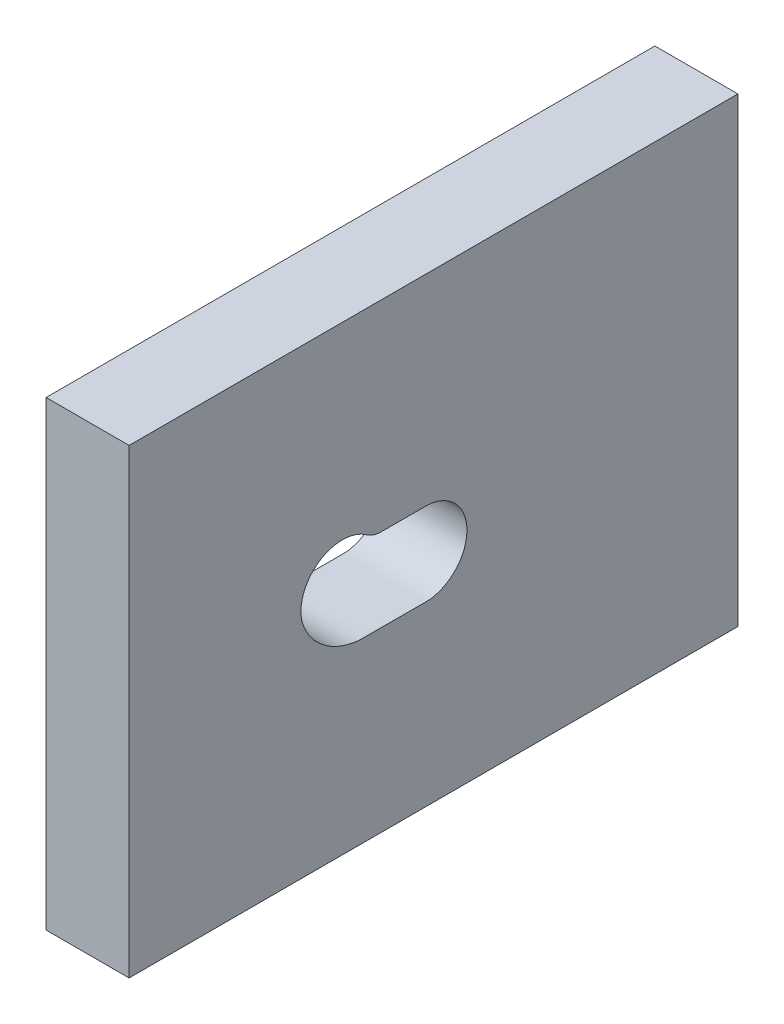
ISO-10303-21;
HEADER;
FILE_DESCRIPTION(('STEP AP214'),'2;1');
FILE_NAME('part.step','',(''),(''),'','','');
FILE_SCHEMA(('AUTOMOTIVE_DESIGN { 1 0 10303 214 1 1 1 1 }'));
ENDSEC;
DATA;
#1=APPLICATION_CONTEXT('core data for automotive mechanical design processes');
#2=APPLICATION_PROTOCOL_DEFINITION('international standard','automotive_design',2000,#1);
#3=PRODUCT_CONTEXT('',#1,'mechanical');
#4=PRODUCT('Part','Part','',(#3));
#5=PRODUCT_RELATED_PRODUCT_CATEGORY('part','',(#4));
#6=PRODUCT_DEFINITION_FORMATION('','',#4);
#7=PRODUCT_DEFINITION_CONTEXT('part definition',#1,'design');
#8=PRODUCT_DEFINITION('design','',#6,#7);
#9=PRODUCT_DEFINITION_SHAPE('','',#8);
#10=(LENGTH_UNIT() NAMED_UNIT(*) SI_UNIT(.MILLI.,.METRE.));
#11=(NAMED_UNIT(*) PLANE_ANGLE_UNIT() SI_UNIT($,.RADIAN.));
#12=(NAMED_UNIT(*) SI_UNIT($,.STERADIAN.) SOLID_ANGLE_UNIT());
#13=UNCERTAINTY_MEASURE_WITH_UNIT(LENGTH_MEASURE(1.E-05),#10,'distance_accuracy_value','');
#14=(GEOMETRIC_REPRESENTATION_CONTEXT(3) GLOBAL_UNCERTAINTY_ASSIGNED_CONTEXT((#13)) GLOBAL_UNIT_ASSIGNED_CONTEXT((#10,
#11,#12)) REPRESENTATION_CONTEXT('',''));
#15=CARTESIAN_POINT('',(0.,0.,0.));
#16=DIRECTION('',(0.,0.,1.));
#17=DIRECTION('',(1.,0.,0.));
#18=AXIS2_PLACEMENT_3D('',#15,#16,#17);
#19=CARTESIAN_POINT('',(20.,-52.7269870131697,60.7218289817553));
#20=DIRECTION('',(1.,0.,0.));
#21=DIRECTION('',(0.,0.,-1.));
#22=AXIS2_PLACEMENT_3D('',#19,#20,#21);
#23=PLANE('',#22);
#24=DIRECTION('',(0.,-1.,0.));
#25=VECTOR('',#24,1.);
#26=CARTESIAN_POINT('',(20.,58.40035883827,60.7218289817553));
#27=LINE('',#26,#25);
#28=CARTESIAN_POINT('',(20.,58.40035883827,60.7218289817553));
#29=VERTEX_POINT('',#28);
#30=CARTESIAN_POINT('',(20.,-52.7269870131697,60.7218289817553));
#31=VERTEX_POINT('',#30);
#32=EDGE_CURVE('E85',#29,#31,#27,.T.);
#33=ORIENTED_EDGE('',*,*,#32,.T.);
#34=DIRECTION('',(0.,0.,-1.));
#35=VECTOR('',#34,1.);
#36=CARTESIAN_POINT('',(20.,-52.7269870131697,60.7218289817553));
#37=LINE('',#36,#35);
#38=CARTESIAN_POINT('',(20.,-52.7269870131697,-85.9508171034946));
#39=VERTEX_POINT('',#38);
#40=EDGE_CURVE('E80',#31,#39,#37,.T.);
#41=ORIENTED_EDGE('',*,*,#40,.T.);
#42=DIRECTION('',(0.,1.,0.));
#43=VECTOR('',#42,1.);
#44=CARTESIAN_POINT('',(20.,58.40035883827,-85.9508171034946));
#45=LINE('',#44,#43);
#46=CARTESIAN_POINT('',(20.,58.40035883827,-85.9508171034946));
#47=VERTEX_POINT('',#46);
#48=EDGE_CURVE('E83',#39,#47,#45,.T.);
#49=ORIENTED_EDGE('',*,*,#48,.T.);
#50=DIRECTION('',(0.,0.,1.));
#51=VECTOR('',#50,1.);
#52=CARTESIAN_POINT('',(20.,58.40035883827,60.7218289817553));
#53=LINE('',#52,#51);
#54=EDGE_CURVE('E50',#47,#29,#53,.T.);
#55=ORIENTED_EDGE('',*,*,#54,.T.);
#56=EDGE_LOOP('',(#33,#41,#49,#55));
#57=FACE_BOUND('',#56,.T.);
#58=CARTESIAN_POINT('',(20.,9.62750723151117,-13.3765263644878));
#59=CARTESIAN_POINT('',(20.,9.70950894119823,-13.0845516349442));
#60=CARTESIAN_POINT('',(20.,9.84694808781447,-12.4931415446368));
#61=CARTESIAN_POINT('',(20.,10.,-11.5824350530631));
#62=CARTESIAN_POINT('',(20.,10.,-10.9758923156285));
#63=CARTESIAN_POINT('',(20.,10.,-10.6726209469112));
#64=CARTESIAN_POINT('',(20.,10.,-10.3761592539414));
#65=CARTESIAN_POINT('',(20.,10.,-9.78323586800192));
#66=CARTESIAN_POINT('',(20.,10.,-8.89385078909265));
#67=CARTESIAN_POINT('',(20.,10.,-8.30092740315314));
#68=CARTESIAN_POINT('',(20.,10.,-8.00446571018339));
#69=CARTESIAN_POINT('',(20.,10.,-5.64718091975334));
#70=CARTESIAN_POINT('',(20.,10.,-3.28989612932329));
#71=CARTESIAN_POINT('',(20.,10.,-0.932611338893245));
#72=CARTESIAN_POINT('',(20.,10.,-0.828987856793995));
#73=CARTESIAN_POINT('',(20.,10.,-0.621740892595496));
#74=CARTESIAN_POINT('',(20.,10.,-0.310870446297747));
#75=CARTESIAN_POINT('',(20.,10.,-0.103623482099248));
#76=CARTESIAN_POINT('',(20.,10.,0.));
#77=CARTESIAN_POINT('',(20.,10.,0.103623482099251));
#78=CARTESIAN_POINT('',(20.,10.,0.31087044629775));
#79=CARTESIAN_POINT('',(20.,10.0296103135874,0.621843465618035));
#80=CARTESIAN_POINT('',(20.,10.0564223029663,0.827418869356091));
#81=CARTESIAN_POINT('',(20.,10.072480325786,0.929790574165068));
#82=CARTESIAN_POINT('',(20.,10.1693169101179,1.54713471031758));
#83=CARTESIAN_POINT('',(20.,10.3606504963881,2.14201500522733));
#84=CARTESIAN_POINT('',(20.,10.6418584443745,2.70005908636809));
#85=CARTESIAN_POINT('',(20.,10.736016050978,2.88691047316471));
#86=CARTESIAN_POINT('',(20.,10.943879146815,3.2507627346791));
#87=CARTESIAN_POINT('',(20.,11.3146934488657,3.75984974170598));
#88=CARTESIAN_POINT('',(20.,11.5366038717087,4.11487740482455));
#89=CARTESIAN_POINT('',(20.,11.6418840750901,4.29569547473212));
#90=CARTESIAN_POINT('',(20.,15.5911182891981,11.078479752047));
#91=CARTESIAN_POINT('',(20.,12.1629177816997,18.1389368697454));
#92=CARTESIAN_POINT('',(20.,4.39042374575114,19.2302433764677));
#93=CARTESIAN_POINT('',(20.,3.2261877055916,19.3937093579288));
#94=CARTESIAN_POINT('',(20.,0.840061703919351,19.3100190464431));
#95=CARTESIAN_POINT('',(20.,-2.79253517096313,17.6462762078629));
#96=CARTESIAN_POINT('',(20.,-4.61172172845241,16.1348207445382));
#97=CARTESIAN_POINT('',(20.,-5.42954649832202,15.2902324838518));
#98=CARTESIAN_POINT('',(20.,-7.38113492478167,13.2747779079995));
#99=CARTESIAN_POINT('',(20.,-8.75772352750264,10.8302414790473));
#100=CARTESIAN_POINT('',(20.,-9.46928539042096,8.11649236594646));
#101=CARTESIAN_POINT('',(20.,-9.58625388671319,7.67039882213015));
#102=CARTESIAN_POINT('',(20.,-9.78216416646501,6.76824089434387));
#103=CARTESIAN_POINT('',(20.,-10.,5.38352076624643));
#104=CARTESIAN_POINT('',(20.,-10.,4.46117358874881));
#105=CARTESIAN_POINT('',(20.,-10.,4.));
#106=CARTESIAN_POINT('',(20.,-10.,3.59242719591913));
#107=CARTESIAN_POINT('',(20.,-10.,2.7772815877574));
#108=CARTESIAN_POINT('',(20.,-10.,1.5545631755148));
#109=CARTESIAN_POINT('',(20.,-10.,0.739417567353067));
#110=CARTESIAN_POINT('',(20.,-10.,0.3318447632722));
#111=CARTESIAN_POINT('',(20.,-10.,-2.113592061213));
#112=CARTESIAN_POINT('',(20.,-10.,-4.55902888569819));
#113=CARTESIAN_POINT('',(20.,-10.,-7.00446571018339));
#114=CARTESIAN_POINT('',(20.,-10.,-7.41203851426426));
#115=CARTESIAN_POINT('',(20.,-10.,-8.22718412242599));
#116=CARTESIAN_POINT('',(20.,-10.,-9.44990253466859));
#117=CARTESIAN_POINT('',(20.,-10.,-10.2650481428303));
#118=CARTESIAN_POINT('',(20.,-10.,-10.6726209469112));
#119=CARTESIAN_POINT('',(20.,-10.,-11.0883960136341));
#120=CARTESIAN_POINT('',(20.,-10.,-11.9199461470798));
#121=CARTESIAN_POINT('',(20.,-9.71015495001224,-13.169456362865));
#122=CARTESIAN_POINT('',(20.,-9.45271553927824,-13.9618515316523));
#123=CARTESIAN_POINT('',(20.,-9.29988093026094,-14.3485173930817));
#124=CARTESIAN_POINT('',(20.,-5.04884890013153,-25.1034699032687));
#125=CARTESIAN_POINT('',(20.,6.50054522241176,-24.510366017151));
#126=CARTESIAN_POINT('',(20.,9.62750723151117,-13.3765263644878));
#127=(BOUNDED_CURVE() B_SPLINE_CURVE(3,(#58,#59,#60,#61,#62,#63,#64,#65,#66,#67,#68,#69,#70,#71,
#72,#73,#74,#75,#76,#77,#78,#79,#80,#81,#82,#83,#84,#85,#86,#87,#88,#89,#90,#91,#92,#93,#94,#95,
#96,#97,#98,#99,#100,#101,#102,#103,#104,#105,#106,#107,#108,#109,#110,#111,#112,#113,#114,#115,
#116,#117,#118,#119,#120,#121,#122,#123,#124,#125,#126),.UNSPECIFIED.,.T.,
.F.) B_SPLINE_CURVE_WITH_KNOTS((4,1,1,3,1,1,3,3,1,1,3,1,1,3,3,1,1,3,3,1,1,3,3,1,1,3,1,1,3,3,1,1,
3,1,1,3,4),(0.,0.00957591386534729,0.0191518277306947,0.028727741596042,0.0380886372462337,
0.0474495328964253,0.056810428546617,0.131242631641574,0.134514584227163,0.137786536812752,
0.141058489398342,0.144330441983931,0.14760239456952,0.15087434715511,0.170446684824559,
0.177053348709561,0.183660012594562,0.190266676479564,0.365004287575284,0.402126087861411,
0.439247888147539,0.476369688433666,0.563022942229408,0.577584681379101,0.592146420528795,
0.606708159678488,0.619577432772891,0.632446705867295,0.645315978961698,0.72253161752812,
0.735400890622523,0.748270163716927,0.76113943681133,0.774267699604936,0.787395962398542,
0.800524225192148,1.),
.UNSPECIFIED.) CURVE() GEOMETRIC_REPRESENTATION_ITEM() RATIONAL_B_SPLINE_CURVE((1.,1.,1.,1.,1.,
1.,1.,1.,1.,1.,1.,1.,1.,1.,1.,1.,1.,1.,1.,1.,1.,1.,1.,1.,0.99194663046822,0.99194663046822,1.,
1.,1.,1.,1.,1.,0.705079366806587,0.705079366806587,1.,1.,1.,1.,1.,1.,0.978200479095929,
0.978200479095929,1.,1.,1.,1.,1.,1.,1.,1.,1.,1.,1.,1.,1.,1.,1.,1.,1.,1.,1.,1.,1.,1.,1.,1.,
0.546273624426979,0.546273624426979,1.)) REPRESENTATION_ITEM(''));
#128=CARTESIAN_POINT('',(20.,9.62750723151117,-13.3765263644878));
#129=VERTEX_POINT('',#128);
#130=EDGE_CURVE('E100',#129,#129,#127,.T.);
#131=ORIENTED_EDGE('',*,*,#130,.F.);
#132=EDGE_LOOP('',(#131));
#133=FACE_BOUND('',#132,.T.);
#134=ADVANCED_FACE('F33',(#57,#133),#23,.T.);
#135=CARTESIAN_POINT('',(0.,-52.7269870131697,60.7218289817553));
#136=DIRECTION('',(1.,0.,0.));
#137=DIRECTION('',(0.,0.,-1.));
#138=AXIS2_PLACEMENT_3D('',#135,#136,#137);
#139=PLANE('',#138);
#140=DIRECTION('',(0.,-1.,0.));
#141=VECTOR('',#140,1.);
#142=CARTESIAN_POINT('',(0.,58.40035883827,60.7218289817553));
#143=LINE('',#142,#141);
#144=CARTESIAN_POINT('',(0.,58.40035883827,60.7218289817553));
#145=VERTEX_POINT('',#144);
#146=CARTESIAN_POINT('',(0.,-52.7269870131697,60.7218289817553));
#147=VERTEX_POINT('',#146);
#148=EDGE_CURVE('E97',#145,#147,#143,.T.);
#149=ORIENTED_EDGE('',*,*,#148,.F.);
#150=DIRECTION('',(0.,0.,1.));
#151=VECTOR('',#150,1.);
#152=CARTESIAN_POINT('',(0.,58.40035883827,60.7218289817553));
#153=LINE('',#152,#151);
#154=CARTESIAN_POINT('',(0.,58.40035883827,-85.9508171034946));
#155=VERTEX_POINT('',#154);
#156=EDGE_CURVE('E73',#155,#145,#153,.T.);
#157=ORIENTED_EDGE('',*,*,#156,.F.);
#158=DIRECTION('',(0.,1.,0.));
#159=VECTOR('',#158,1.);
#160=CARTESIAN_POINT('',(0.,58.40035883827,-85.9508171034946));
#161=LINE('',#160,#159);
#162=CARTESIAN_POINT('',(0.,-52.7269870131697,-85.9508171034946));
#163=VERTEX_POINT('',#162);
#164=EDGE_CURVE('E67',#163,#155,#161,.T.);
#165=ORIENTED_EDGE('',*,*,#164,.F.);
#166=DIRECTION('',(0.,0.,-1.));
#167=VECTOR('',#166,1.);
#168=CARTESIAN_POINT('',(0.,-52.7269870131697,60.7218289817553));
#169=LINE('',#168,#167);
#170=EDGE_CURVE('E89',#147,#163,#169,.T.);
#171=ORIENTED_EDGE('',*,*,#170,.F.);
#172=EDGE_LOOP('',(#149,#157,#165,#171));
#173=FACE_BOUND('',#172,.T.);
#174=CARTESIAN_POINT('',(0.,9.62750723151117,-13.3765263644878));
#175=CARTESIAN_POINT('',(0.,9.70950894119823,-13.0845516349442));
#176=CARTESIAN_POINT('',(0.,9.84694808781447,-12.4931415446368));
#177=CARTESIAN_POINT('',(0.,10.,-11.5824350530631));
#178=CARTESIAN_POINT('',(0.,10.,-10.9758923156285));
#179=CARTESIAN_POINT('',(0.,10.,-10.6726209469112));
#180=CARTESIAN_POINT('',(0.,10.,-10.3761592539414));
#181=CARTESIAN_POINT('',(0.,10.,-9.78323586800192));
#182=CARTESIAN_POINT('',(0.,10.,-8.89385078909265));
#183=CARTESIAN_POINT('',(0.,10.,-8.30092740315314));
#184=CARTESIAN_POINT('',(0.,10.,-8.00446571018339));
#185=CARTESIAN_POINT('',(0.,10.,-5.64718091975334));
#186=CARTESIAN_POINT('',(0.,10.,-3.28989612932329));
#187=CARTESIAN_POINT('',(0.,10.,-0.932611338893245));
#188=CARTESIAN_POINT('',(0.,10.,-0.828987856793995));
#189=CARTESIAN_POINT('',(0.,10.,-0.621740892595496));
#190=CARTESIAN_POINT('',(0.,10.,-0.310870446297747));
#191=CARTESIAN_POINT('',(0.,10.,-0.103623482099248));
#192=CARTESIAN_POINT('',(0.,10.,0.));
#193=CARTESIAN_POINT('',(0.,10.,0.103623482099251));
#194=CARTESIAN_POINT('',(0.,10.,0.31087044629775));
#195=CARTESIAN_POINT('',(0.,10.0296103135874,0.621843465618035));
#196=CARTESIAN_POINT('',(0.,10.0564223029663,0.827418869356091));
#197=CARTESIAN_POINT('',(0.,10.072480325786,0.929790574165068));
#198=CARTESIAN_POINT('',(0.,10.1693169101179,1.54713471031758));
#199=CARTESIAN_POINT('',(0.,10.3606504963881,2.14201500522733));
#200=CARTESIAN_POINT('',(0.,10.6418584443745,2.70005908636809));
#201=CARTESIAN_POINT('',(0.,10.736016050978,2.88691047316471));
#202=CARTESIAN_POINT('',(0.,10.943879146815,3.2507627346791));
#203=CARTESIAN_POINT('',(0.,11.3146934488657,3.75984974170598));
#204=CARTESIAN_POINT('',(0.,11.5366038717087,4.11487740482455));
#205=CARTESIAN_POINT('',(0.,11.6418840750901,4.29569547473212));
#206=CARTESIAN_POINT('',(0.,15.5911182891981,11.078479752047));
#207=CARTESIAN_POINT('',(0.,12.1629177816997,18.1389368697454));
#208=CARTESIAN_POINT('',(0.,4.39042374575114,19.2302433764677));
#209=CARTESIAN_POINT('',(0.,3.2261877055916,19.3937093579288));
#210=CARTESIAN_POINT('',(0.,0.840061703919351,19.3100190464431));
#211=CARTESIAN_POINT('',(0.,-2.79253517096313,17.6462762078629));
#212=CARTESIAN_POINT('',(0.,-4.61172172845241,16.1348207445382));
#213=CARTESIAN_POINT('',(0.,-5.42954649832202,15.2902324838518));
#214=CARTESIAN_POINT('',(0.,-7.38113492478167,13.2747779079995));
#215=CARTESIAN_POINT('',(0.,-8.75772352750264,10.8302414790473));
#216=CARTESIAN_POINT('',(0.,-9.46928539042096,8.11649236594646));
#217=CARTESIAN_POINT('',(0.,-9.58625388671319,7.67039882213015));
#218=CARTESIAN_POINT('',(0.,-9.78216416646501,6.76824089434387));
#219=CARTESIAN_POINT('',(0.,-10.,5.38352076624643));
#220=CARTESIAN_POINT('',(0.,-10.,4.46117358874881));
#221=CARTESIAN_POINT('',(0.,-10.,4.));
#222=CARTESIAN_POINT('',(0.,-10.,3.59242719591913));
#223=CARTESIAN_POINT('',(0.,-10.,2.7772815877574));
#224=CARTESIAN_POINT('',(0.,-10.,1.5545631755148));
#225=CARTESIAN_POINT('',(0.,-10.,0.739417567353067));
#226=CARTESIAN_POINT('',(0.,-10.,0.3318447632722));
#227=CARTESIAN_POINT('',(0.,-10.,-2.113592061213));
#228=CARTESIAN_POINT('',(0.,-10.,-4.55902888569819));
#229=CARTESIAN_POINT('',(0.,-10.,-7.00446571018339));
#230=CARTESIAN_POINT('',(0.,-10.,-7.41203851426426));
#231=CARTESIAN_POINT('',(0.,-10.,-8.22718412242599));
#232=CARTESIAN_POINT('',(0.,-10.,-9.44990253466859));
#233=CARTESIAN_POINT('',(0.,-10.,-10.2650481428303));
#234=CARTESIAN_POINT('',(0.,-10.,-10.6726209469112));
#235=CARTESIAN_POINT('',(0.,-10.,-11.0883960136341));
#236=CARTESIAN_POINT('',(0.,-10.,-11.9199461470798));
#237=CARTESIAN_POINT('',(0.,-9.71015495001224,-13.169456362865));
#238=CARTESIAN_POINT('',(0.,-9.45271553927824,-13.9618515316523));
#239=CARTESIAN_POINT('',(0.,-9.29988093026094,-14.3485173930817));
#240=CARTESIAN_POINT('',(0.,-5.04884890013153,-25.1034699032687));
#241=CARTESIAN_POINT('',(0.,6.50054522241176,-24.510366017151));
#242=CARTESIAN_POINT('',(0.,9.62750723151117,-13.3765263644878));
#243=(BOUNDED_CURVE() B_SPLINE_CURVE(3,(#174,#175,#176,#177,#178,#179,#180,#181,#182,#183,#184,
#185,#186,#187,#188,#189,#190,#191,#192,#193,#194,#195,#196,#197,#198,#199,#200,#201,#202,#203,
#204,#205,#206,#207,#208,#209,#210,#211,#212,#213,#214,#215,#216,#217,#218,#219,#220,#221,#222,
#223,#224,#225,#226,#227,#228,#229,#230,#231,#232,#233,#234,#235,#236,#237,#238,#239,#240,#241,
#242),.UNSPECIFIED.,.T.,.F.) B_SPLINE_CURVE_WITH_KNOTS((4,1,1,3,1,1,3,3,1,1,3,1,1,3,3,1,1,3,3,1,
1,3,3,1,1,3,1,1,3,3,1,1,3,1,1,3,4),(0.,0.00957591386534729,0.0191518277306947,0.028727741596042,
0.0380886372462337,0.0474495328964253,0.056810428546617,0.131242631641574,0.134514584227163,
0.137786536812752,0.141058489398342,0.144330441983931,0.14760239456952,0.15087434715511,
0.170446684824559,0.177053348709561,0.183660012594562,0.190266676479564,0.365004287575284,
0.402126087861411,0.439247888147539,0.476369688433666,0.563022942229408,0.577584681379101,
0.592146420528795,0.606708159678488,0.619577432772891,0.632446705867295,0.645315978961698,
0.72253161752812,0.735400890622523,0.748270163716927,0.76113943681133,0.774267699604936,
0.787395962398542,0.800524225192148,1.),
.UNSPECIFIED.) CURVE() GEOMETRIC_REPRESENTATION_ITEM() RATIONAL_B_SPLINE_CURVE((1.,1.,1.,1.,1.,
1.,1.,1.,1.,1.,1.,1.,1.,1.,1.,1.,1.,1.,1.,1.,1.,1.,1.,1.,0.99194663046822,0.99194663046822,1.,
1.,1.,1.,1.,1.,0.705079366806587,0.705079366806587,1.,1.,1.,1.,1.,1.,0.978200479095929,
0.978200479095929,1.,1.,1.,1.,1.,1.,1.,1.,1.,1.,1.,1.,1.,1.,1.,1.,1.,1.,1.,1.,1.,1.,1.,1.,
0.546273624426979,0.546273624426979,1.)) REPRESENTATION_ITEM(''));
#244=CARTESIAN_POINT('',(0.,9.62750723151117,-13.3765263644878));
#245=VERTEX_POINT('',#244);
#246=EDGE_CURVE('E112',#245,#245,#243,.T.);
#247=ORIENTED_EDGE('',*,*,#246,.T.);
#248=EDGE_LOOP('',(#247));
#249=FACE_BOUND('',#248,.T.);
#250=ADVANCED_FACE('F108',(#173,#249),#139,.F.);
#251=CARTESIAN_POINT('',(20.,58.40035883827,60.7218289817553));
#252=DIRECTION('',(0.,0.,-1.));
#253=DIRECTION('',(0.,1.,0.));
#254=AXIS2_PLACEMENT_3D('',#251,#252,#253);
#255=PLANE('',#254);
#256=ORIENTED_EDGE('',*,*,#148,.T.);
#257=DIRECTION('',(-1.,0.,0.));
#258=VECTOR('',#257,1.);
#259=CARTESIAN_POINT('',(20.,-52.7269870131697,60.7218289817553));
#260=LINE('',#259,#258);
#261=EDGE_CURVE('E11',#31,#147,#260,.T.);
#262=ORIENTED_EDGE('',*,*,#261,.F.);
#263=ORIENTED_EDGE('',*,*,#32,.F.);
#264=DIRECTION('',(-1.,0.,0.));
#265=VECTOR('',#264,1.);
#266=CARTESIAN_POINT('',(20.,58.40035883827,60.7218289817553));
#267=LINE('',#266,#265);
#268=EDGE_CURVE('E93',#29,#145,#267,.T.);
#269=ORIENTED_EDGE('',*,*,#268,.T.);
#270=EDGE_LOOP('',(#256,#262,#263,#269));
#271=FACE_BOUND('',#270,.T.);
#272=ADVANCED_FACE('F35',(#271),#255,.F.);
#273=CARTESIAN_POINT('',(20.,-52.7269870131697,60.7218289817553));
#274=DIRECTION('',(0.,1.,0.));
#275=DIRECTION('',(0.,0.,1.));
#276=AXIS2_PLACEMENT_3D('',#273,#274,#275);
#277=PLANE('',#276);
#278=ORIENTED_EDGE('',*,*,#170,.T.);
#279=DIRECTION('',(-1.,0.,0.));
#280=VECTOR('',#279,1.);
#281=CARTESIAN_POINT('',(20.,-52.7269870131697,-85.9508171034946));
#282=LINE('',#281,#280);
#283=EDGE_CURVE('E42',#39,#163,#282,.T.);
#284=ORIENTED_EDGE('',*,*,#283,.F.);
#285=ORIENTED_EDGE('',*,*,#40,.F.);
#286=ORIENTED_EDGE('',*,*,#261,.T.);
#287=EDGE_LOOP('',(#278,#284,#285,#286));
#288=FACE_BOUND('',#287,.T.);
#289=ADVANCED_FACE('F88',(#288),#277,.F.);
#290=CARTESIAN_POINT('',(20.,58.40035883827,-85.9508171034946));
#291=DIRECTION('',(0.,0.,1.));
#292=DIRECTION('',(1.,0.,0.));
#293=AXIS2_PLACEMENT_3D('',#290,#291,#292);
#294=PLANE('',#293);
#295=ORIENTED_EDGE('',*,*,#164,.T.);
#296=DIRECTION('',(-1.,0.,0.));
#297=VECTOR('',#296,1.);
#298=CARTESIAN_POINT('',(20.,58.40035883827,-85.9508171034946));
#299=LINE('',#298,#297);
#300=EDGE_CURVE('E90',#47,#155,#299,.T.);
#301=ORIENTED_EDGE('',*,*,#300,.F.);
#302=ORIENTED_EDGE('',*,*,#48,.F.);
#303=ORIENTED_EDGE('',*,*,#283,.T.);
#304=EDGE_LOOP('',(#295,#301,#302,#303));
#305=FACE_BOUND('',#304,.T.);
#306=ADVANCED_FACE('F91',(#305),#294,.F.);
#307=CARTESIAN_POINT('',(20.,58.40035883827,60.7218289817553));
#308=DIRECTION('',(0.,-1.,0.));
#309=DIRECTION('',(0.,0.,-1.));
#310=AXIS2_PLACEMENT_3D('',#307,#308,#309);
#311=PLANE('',#310);
#312=ORIENTED_EDGE('',*,*,#156,.T.);
#313=ORIENTED_EDGE('',*,*,#268,.F.);
#314=ORIENTED_EDGE('',*,*,#54,.F.);
#315=ORIENTED_EDGE('',*,*,#300,.T.);
#316=EDGE_LOOP('',(#312,#313,#314,#315));
#317=FACE_BOUND('',#316,.T.);
#318=ADVANCED_FACE('F105',(#317),#311,.F.);
#319=DIRECTION('',(-1.,0.,0.));
#320=VECTOR('',#319,1.);
#321=SURFACE_OF_LINEAR_EXTRUSION('',#127,#320);
#322=ORIENTED_EDGE('',*,*,#130,.T.);
#323=EDGE_LOOP('',(#322));
#324=FACE_BOUND('',#323,.T.);
#325=ORIENTED_EDGE('',*,*,#246,.F.);
#326=EDGE_LOOP('',(#325));
#327=FACE_BOUND('',#326,.T.);
#328=ADVANCED_FACE('F128',(#324,#327),#321,.T.);
#329=CLOSED_SHELL('',(#134,#250,#272,#289,#306,#318,#328));
#330=MANIFOLD_SOLID_BREP('B2',#329);
#331=ADVANCED_BREP_SHAPE_REPRESENTATION('',(#18,#330),#14);
#332=SHAPE_DEFINITION_REPRESENTATION(#9,#331);
ENDSEC;
END-ISO-10303-21;
